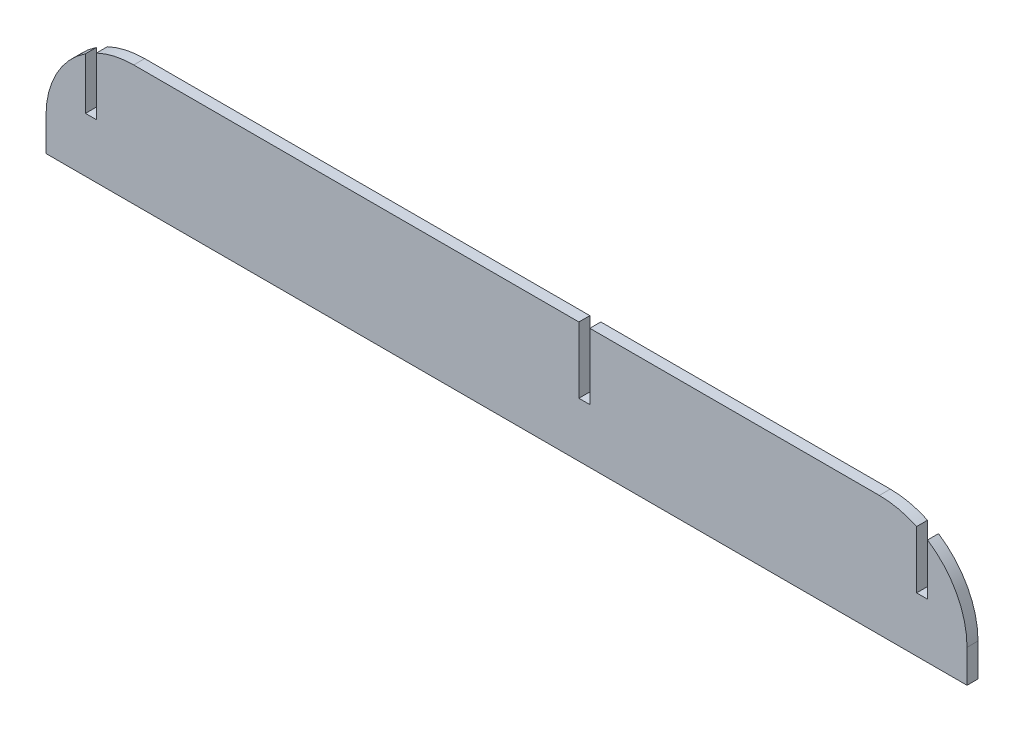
ISO-10303-21;
HEADER;
FILE_DESCRIPTION(('STEP AP214'),'2;1');
FILE_NAME('part.step','',(''),(''),'','','');
FILE_SCHEMA(('AUTOMOTIVE_DESIGN { 1 0 10303 214 1 1 1 1 }'));
ENDSEC;
DATA;
#1=APPLICATION_CONTEXT('core data for automotive mechanical design processes');
#2=APPLICATION_PROTOCOL_DEFINITION('international standard','automotive_design',2000,#1);
#3=PRODUCT_CONTEXT('',#1,'mechanical');
#4=PRODUCT('Part','Part','',(#3));
#5=PRODUCT_RELATED_PRODUCT_CATEGORY('part','',(#4));
#6=PRODUCT_DEFINITION_FORMATION('','',#4);
#7=PRODUCT_DEFINITION_CONTEXT('part definition',#1,'design');
#8=PRODUCT_DEFINITION('design','',#6,#7);
#9=PRODUCT_DEFINITION_SHAPE('','',#8);
#10=(LENGTH_UNIT() NAMED_UNIT(*) SI_UNIT(.MILLI.,.METRE.));
#11=(NAMED_UNIT(*) PLANE_ANGLE_UNIT() SI_UNIT($,.RADIAN.));
#12=(NAMED_UNIT(*) SI_UNIT($,.STERADIAN.) SOLID_ANGLE_UNIT());
#13=UNCERTAINTY_MEASURE_WITH_UNIT(LENGTH_MEASURE(1.E-05),#10,'distance_accuracy_value','');
#14=(GEOMETRIC_REPRESENTATION_CONTEXT(3) GLOBAL_UNCERTAINTY_ASSIGNED_CONTEXT((#13)) GLOBAL_UNIT_ASSIGNED_CONTEXT((#10,
#11,#12)) REPRESENTATION_CONTEXT('',''));
#15=CARTESIAN_POINT('',(0.,0.,0.));
#16=DIRECTION('',(0.,0.,1.));
#17=DIRECTION('',(1.,0.,0.));
#18=AXIS2_PLACEMENT_3D('',#15,#16,#17);
#19=CARTESIAN_POINT('',(-210.,55.,5.));
#20=DIRECTION('',(0.,-1.,0.));
#21=DIRECTION('',(0.,0.,-1.));
#22=AXIS2_PLACEMENT_3D('',#19,#20,#21);
#23=PLANE('',#22);
#24=DIRECTION('',(0.,0.,-1.));
#25=VECTOR('',#24,1.);
#26=CARTESIAN_POINT('',(33.,55.,5.));
#27=LINE('',#26,#25);
#28=CARTESIAN_POINT('',(33.,55.,5.));
#29=VERTEX_POINT('',#28);
#30=CARTESIAN_POINT('',(33.,55.,0.));
#31=VERTEX_POINT('',#30);
#32=EDGE_CURVE('E201',#29,#31,#27,.T.);
#33=ORIENTED_EDGE('',*,*,#32,.T.);
#34=DIRECTION('',(-1.,0.,0.));
#35=VECTOR('',#34,1.);
#36=CARTESIAN_POINT('',(-210.,55.,0.));
#37=LINE('',#36,#35);
#38=CARTESIAN_POINT('',(-170.,55.,0.));
#39=VERTEX_POINT('',#38);
#40=EDGE_CURVE('E254',#31,#39,#37,.T.);
#41=ORIENTED_EDGE('',*,*,#40,.T.);
#42=DIRECTION('',(0.,0.,-1.));
#43=VECTOR('',#42,1.);
#44=CARTESIAN_POINT('',(-170.,55.,5.));
#45=LINE('',#44,#43);
#46=CARTESIAN_POINT('',(-170.,55.,5.));
#47=VERTEX_POINT('',#46);
#48=EDGE_CURVE('E262',#39,#47,#45,.F.);
#49=ORIENTED_EDGE('',*,*,#48,.T.);
#50=DIRECTION('',(-1.,0.,0.));
#51=VECTOR('',#50,1.);
#52=CARTESIAN_POINT('',(-210.,55.,5.));
#53=LINE('',#52,#51);
#54=EDGE_CURVE('E243',#29,#47,#53,.T.);
#55=ORIENTED_EDGE('',*,*,#54,.F.);
#56=EDGE_LOOP('',(#33,#41,#49,#55));
#57=FACE_BOUND('',#56,.T.);
#58=ADVANCED_FACE('F33',(#57),#23,.F.);
#59=CARTESIAN_POINT('',(0.,0.,5.));
#60=DIRECTION('',(0.,0.,-1.));
#61=DIRECTION('',(-1.,0.,0.));
#62=AXIS2_PLACEMENT_3D('',#59,#60,#61);
#63=PLANE('',#62);
#64=DIRECTION('',(0.,-1.,0.));
#65=VECTOR('',#64,1.);
#66=CARTESIAN_POINT('',(186.999999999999,0.,5.));
#67=LINE('',#66,#65);
#68=CARTESIAN_POINT('',(186.999999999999,51.2077339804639,5.));
#69=VERTEX_POINT('',#68);
#70=CARTESIAN_POINT('',(186.999999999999,25.,5.));
#71=VERTEX_POINT('',#70);
#72=EDGE_CURVE('E179',#69,#71,#67,.T.);
#73=ORIENTED_EDGE('',*,*,#72,.F.);
#74=CARTESIAN_POINT('',(170.,15.,5.));
#75=DIRECTION('',(0.,0.,-1.));
#76=DIRECTION('',(-1.,0.,0.));
#77=AXIS2_PLACEMENT_3D('',#74,#75,#76);
#78=CIRCLE('',#77,40.);
#79=CARTESIAN_POINT('',(170.,55.,5.));
#80=VERTEX_POINT('',#79);
#81=EDGE_CURVE('E282',#69,#80,#78,.F.);
#82=ORIENTED_EDGE('',*,*,#81,.T.);
#83=CARTESIAN_POINT('',(38.,55.,5.));
#84=VERTEX_POINT('',#83);
#85=EDGE_CURVE('E244',#80,#84,#53,.T.);
#86=ORIENTED_EDGE('',*,*,#85,.T.);
#87=DIRECTION('',(0.,-1.,0.));
#88=VECTOR('',#87,1.);
#89=CARTESIAN_POINT('',(38.,0.,5.));
#90=LINE('',#89,#88);
#91=CARTESIAN_POINT('',(38.,24.8636187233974,5.));
#92=VERTEX_POINT('',#91);
#93=EDGE_CURVE('E194',#84,#92,#90,.T.);
#94=ORIENTED_EDGE('',*,*,#93,.T.);
#95=DIRECTION('',(-1.,0.,0.));
#96=VECTOR('',#95,1.);
#97=CARTESIAN_POINT('',(0.,24.8636187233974,5.));
#98=LINE('',#97,#96);
#99=CARTESIAN_POINT('',(33.,24.8636187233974,5.));
#100=VERTEX_POINT('',#99);
#101=EDGE_CURVE('E198',#92,#100,#98,.T.);
#102=ORIENTED_EDGE('',*,*,#101,.T.);
#103=DIRECTION('',(0.,-1.,0.));
#104=VECTOR('',#103,1.);
#105=CARTESIAN_POINT('',(33.,0.,5.));
#106=LINE('',#105,#104);
#107=EDGE_CURVE('E192',#29,#100,#106,.T.);
#108=ORIENTED_EDGE('',*,*,#107,.F.);
#109=ORIENTED_EDGE('',*,*,#54,.T.);
#110=CARTESIAN_POINT('',(-170.,15.,5.));
#111=DIRECTION('',(0.,0.,-1.));
#112=DIRECTION('',(-1.,0.,0.));
#113=AXIS2_PLACEMENT_3D('',#110,#111,#112);
#114=CIRCLE('',#113,40.);
#115=CARTESIAN_POINT('',(-187.000000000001,51.2077339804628,5.));
#116=VERTEX_POINT('',#115);
#117=EDGE_CURVE('E279',#47,#116,#114,.F.);
#118=ORIENTED_EDGE('',*,*,#117,.T.);
#119=DIRECTION('',(0.,-1.,0.));
#120=VECTOR('',#119,1.);
#121=CARTESIAN_POINT('',(-187.000000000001,0.,5.));
#122=LINE('',#121,#120);
#123=CARTESIAN_POINT('',(-187.000000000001,24.8636187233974,5.));
#124=VERTEX_POINT('',#123);
#125=EDGE_CURVE('E218',#116,#124,#122,.T.);
#126=ORIENTED_EDGE('',*,*,#125,.T.);
#127=DIRECTION('',(-1.,0.,0.));
#128=VECTOR('',#127,1.);
#129=CARTESIAN_POINT('',(0.,24.8636187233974,5.));
#130=LINE('',#129,#128);
#131=CARTESIAN_POINT('',(-192.000000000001,24.8636187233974,5.));
#132=VERTEX_POINT('',#131);
#133=EDGE_CURVE('E222',#124,#132,#130,.T.);
#134=ORIENTED_EDGE('',*,*,#133,.T.);
#135=DIRECTION('',(0.,-1.,0.));
#136=VECTOR('',#135,1.);
#137=CARTESIAN_POINT('',(-192.000000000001,0.,5.));
#138=LINE('',#137,#136);
#139=CARTESIAN_POINT('',(-192.000000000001,48.4065861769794,5.));
#140=VERTEX_POINT('',#139);
#141=EDGE_CURVE('E216',#140,#132,#138,.T.);
#142=ORIENTED_EDGE('',*,*,#141,.F.);
#143=CARTESIAN_POINT('',(-210.,15.,5.));
#144=VERTEX_POINT('',#143);
#145=EDGE_CURVE('E278',#140,#144,#114,.F.);
#146=ORIENTED_EDGE('',*,*,#145,.T.);
#147=DIRECTION('',(0.,-1.,0.));
#148=VECTOR('',#147,1.);
#149=CARTESIAN_POINT('',(-210.,0.,5.));
#150=LINE('',#149,#148);
#151=CARTESIAN_POINT('',(-210.,0.,5.));
#152=VERTEX_POINT('',#151);
#153=EDGE_CURVE('E236',#144,#152,#150,.T.);
#154=ORIENTED_EDGE('',*,*,#153,.T.);
#155=DIRECTION('',(1.,0.,0.));
#156=VECTOR('',#155,1.);
#157=CARTESIAN_POINT('',(-210.,0.,5.));
#158=LINE('',#157,#156);
#159=CARTESIAN_POINT('',(210.,0.,5.));
#160=VERTEX_POINT('',#159);
#161=EDGE_CURVE('E238',#152,#160,#158,.T.);
#162=ORIENTED_EDGE('',*,*,#161,.T.);
#163=DIRECTION('',(0.,1.,0.));
#164=VECTOR('',#163,1.);
#165=CARTESIAN_POINT('',(210.,0.,5.));
#166=LINE('',#165,#164);
#167=CARTESIAN_POINT('',(210.,15.,5.));
#168=VERTEX_POINT('',#167);
#169=EDGE_CURVE('E241',#160,#168,#166,.T.);
#170=ORIENTED_EDGE('',*,*,#169,.T.);
#171=CARTESIAN_POINT('',(191.999999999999,48.4065861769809,5.));
#172=VERTEX_POINT('',#171);
#173=EDGE_CURVE('E178',#168,#172,#78,.F.);
#174=ORIENTED_EDGE('',*,*,#173,.T.);
#175=DIRECTION('',(0.,-1.,0.));
#176=VECTOR('',#175,1.);
#177=CARTESIAN_POINT('',(191.999999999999,0.,5.));
#178=LINE('',#177,#176);
#179=CARTESIAN_POINT('',(191.999999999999,25.,5.));
#180=VERTEX_POINT('',#179);
#181=EDGE_CURVE('E56',#172,#180,#178,.T.);
#182=ORIENTED_EDGE('',*,*,#181,.T.);
#183=DIRECTION('',(-1.,0.,0.));
#184=VECTOR('',#183,1.);
#185=CARTESIAN_POINT('',(0.,25.,5.));
#186=LINE('',#185,#184);
#187=EDGE_CURVE('E166',#180,#71,#186,.T.);
#188=ORIENTED_EDGE('',*,*,#187,.T.);
#189=EDGE_LOOP('',(#73,#82,#86,#94,#102,#108,#109,#118,#126,#134,#142,#146,#154,#162,#170,#174,
#182,#188));
#190=FACE_BOUND('',#189,.T.);
#191=ADVANCED_FACE('F175',(#190),#63,.F.);
#192=CARTESIAN_POINT('',(0.,0.,0.));
#193=DIRECTION('',(0.,0.,-1.));
#194=DIRECTION('',(-1.,0.,0.));
#195=AXIS2_PLACEMENT_3D('',#192,#193,#194);
#196=PLANE('',#195);
#197=CARTESIAN_POINT('',(170.,15.,0.));
#198=DIRECTION('',(0.,0.,-1.));
#199=DIRECTION('',(-1.,0.,0.));
#200=AXIS2_PLACEMENT_3D('',#197,#198,#199);
#201=CIRCLE('',#200,40.);
#202=CARTESIAN_POINT('',(170.,55.,0.));
#203=VERTEX_POINT('',#202);
#204=CARTESIAN_POINT('',(186.999999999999,51.2077339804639,0.));
#205=VERTEX_POINT('',#204);
#206=EDGE_CURVE('E273',#203,#205,#201,.T.);
#207=ORIENTED_EDGE('',*,*,#206,.T.);
#208=DIRECTION('',(0.,-1.,0.));
#209=VECTOR('',#208,1.);
#210=CARTESIAN_POINT('',(186.999999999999,0.,0.));
#211=LINE('',#210,#209);
#212=CARTESIAN_POINT('',(186.999999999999,25.,0.));
#213=VERTEX_POINT('',#212);
#214=EDGE_CURVE('E184',#205,#213,#211,.T.);
#215=ORIENTED_EDGE('',*,*,#214,.T.);
#216=DIRECTION('',(-1.,0.,0.));
#217=VECTOR('',#216,1.);
#218=CARTESIAN_POINT('',(0.,25.,0.));
#219=LINE('',#218,#217);
#220=CARTESIAN_POINT('',(191.999999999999,25.,0.));
#221=VERTEX_POINT('',#220);
#222=EDGE_CURVE('E181',#221,#213,#219,.T.);
#223=ORIENTED_EDGE('',*,*,#222,.F.);
#224=DIRECTION('',(0.,-1.,0.));
#225=VECTOR('',#224,1.);
#226=CARTESIAN_POINT('',(191.999999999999,0.,0.));
#227=LINE('',#226,#225);
#228=CARTESIAN_POINT('',(191.999999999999,48.4065861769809,0.));
#229=VERTEX_POINT('',#228);
#230=EDGE_CURVE('E161',#229,#221,#227,.T.);
#231=ORIENTED_EDGE('',*,*,#230,.F.);
#232=CARTESIAN_POINT('',(210.,15.,0.));
#233=VERTEX_POINT('',#232);
#234=EDGE_CURVE('E272',#229,#233,#201,.T.);
#235=ORIENTED_EDGE('',*,*,#234,.T.);
#236=DIRECTION('',(0.,1.,0.));
#237=VECTOR('',#236,1.);
#238=CARTESIAN_POINT('',(210.,0.,0.));
#239=LINE('',#238,#237);
#240=CARTESIAN_POINT('',(210.,0.,0.));
#241=VERTEX_POINT('',#240);
#242=EDGE_CURVE('E251',#241,#233,#239,.T.);
#243=ORIENTED_EDGE('',*,*,#242,.F.);
#244=DIRECTION('',(1.,0.,0.));
#245=VECTOR('',#244,1.);
#246=CARTESIAN_POINT('',(-210.,0.,0.));
#247=LINE('',#246,#245);
#248=CARTESIAN_POINT('',(-210.,0.,0.));
#249=VERTEX_POINT('',#248);
#250=EDGE_CURVE('E249',#249,#241,#247,.T.);
#251=ORIENTED_EDGE('',*,*,#250,.F.);
#252=DIRECTION('',(0.,-1.,0.));
#253=VECTOR('',#252,1.);
#254=CARTESIAN_POINT('',(-210.,0.,0.));
#255=LINE('',#254,#253);
#256=CARTESIAN_POINT('',(-210.,15.,0.));
#257=VERTEX_POINT('',#256);
#258=EDGE_CURVE('E190',#257,#249,#255,.T.);
#259=ORIENTED_EDGE('',*,*,#258,.F.);
#260=CARTESIAN_POINT('',(-170.,15.,0.));
#261=DIRECTION('',(0.,0.,-1.));
#262=DIRECTION('',(-1.,0.,0.));
#263=AXIS2_PLACEMENT_3D('',#260,#261,#262);
#264=CIRCLE('',#263,40.);
#265=CARTESIAN_POINT('',(-192.000000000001,48.4065861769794,0.));
#266=VERTEX_POINT('',#265);
#267=EDGE_CURVE('E269',#257,#266,#264,.T.);
#268=ORIENTED_EDGE('',*,*,#267,.T.);
#269=DIRECTION('',(0.,-1.,0.));
#270=VECTOR('',#269,1.);
#271=CARTESIAN_POINT('',(-192.000000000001,0.,0.));
#272=LINE('',#271,#270);
#273=CARTESIAN_POINT('',(-192.000000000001,24.8636187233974,0.));
#274=VERTEX_POINT('',#273);
#275=EDGE_CURVE('E226',#266,#274,#272,.T.);
#276=ORIENTED_EDGE('',*,*,#275,.T.);
#277=DIRECTION('',(-1.,0.,0.));
#278=VECTOR('',#277,1.);
#279=CARTESIAN_POINT('',(0.,24.8636187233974,0.));
#280=LINE('',#279,#278);
#281=CARTESIAN_POINT('',(-187.000000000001,24.8636187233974,0.));
#282=VERTEX_POINT('',#281);
#283=EDGE_CURVE('E219',#282,#274,#280,.T.);
#284=ORIENTED_EDGE('',*,*,#283,.F.);
#285=DIRECTION('',(0.,-1.,0.));
#286=VECTOR('',#285,1.);
#287=CARTESIAN_POINT('',(-187.000000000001,0.,0.));
#288=LINE('',#287,#286);
#289=CARTESIAN_POINT('',(-187.000000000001,51.2077339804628,0.));
#290=VERTEX_POINT('',#289);
#291=EDGE_CURVE('E229',#290,#282,#288,.T.);
#292=ORIENTED_EDGE('',*,*,#291,.F.);
#293=EDGE_CURVE('E268',#290,#39,#264,.T.);
#294=ORIENTED_EDGE('',*,*,#293,.T.);
#295=ORIENTED_EDGE('',*,*,#40,.F.);
#296=DIRECTION('',(0.,-1.,0.));
#297=VECTOR('',#296,1.);
#298=CARTESIAN_POINT('',(33.,0.,0.));
#299=LINE('',#298,#297);
#300=CARTESIAN_POINT('',(33.,24.8636187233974,0.));
#301=VERTEX_POINT('',#300);
#302=EDGE_CURVE('E202',#31,#301,#299,.T.);
#303=ORIENTED_EDGE('',*,*,#302,.T.);
#304=DIRECTION('',(-1.,0.,0.));
#305=VECTOR('',#304,1.);
#306=CARTESIAN_POINT('',(0.,24.8636187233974,0.));
#307=LINE('',#306,#305);
#308=CARTESIAN_POINT('',(38.,24.8636187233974,0.));
#309=VERTEX_POINT('',#308);
#310=EDGE_CURVE('E195',#309,#301,#307,.T.);
#311=ORIENTED_EDGE('',*,*,#310,.F.);
#312=DIRECTION('',(0.,-1.,0.));
#313=VECTOR('',#312,1.);
#314=CARTESIAN_POINT('',(38.,0.,0.));
#315=LINE('',#314,#313);
#316=CARTESIAN_POINT('',(38.,55.,0.));
#317=VERTEX_POINT('',#316);
#318=EDGE_CURVE('E205',#317,#309,#315,.T.);
#319=ORIENTED_EDGE('',*,*,#318,.F.);
#320=EDGE_CURVE('E239',#203,#317,#37,.T.);
#321=ORIENTED_EDGE('',*,*,#320,.F.);
#322=EDGE_LOOP('',(#207,#215,#223,#231,#235,#243,#251,#259,#268,#276,#284,#292,#294,#295,#303,
#311,#319,#321));
#323=FACE_BOUND('',#322,.T.);
#324=ADVANCED_FACE('F294',(#323),#196,.T.);
#325=CARTESIAN_POINT('',(170.,15.,5.));
#326=DIRECTION('',(0.,0.,-1.));
#327=DIRECTION('',(-1.,0.,0.));
#328=AXIS2_PLACEMENT_3D('',#325,#326,#327);
#329=CYLINDRICAL_SURFACE('',#328,40.);
#330=ORIENTED_EDGE('',*,*,#81,.F.);
#331=DIRECTION('',(0.,0.,-1.));
#332=VECTOR('',#331,1.);
#333=CARTESIAN_POINT('',(186.999999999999,51.2077339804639,5.));
#334=LINE('',#333,#332);
#335=EDGE_CURVE('E11',#69,#205,#334,.T.);
#336=ORIENTED_EDGE('',*,*,#335,.T.);
#337=ORIENTED_EDGE('',*,*,#206,.F.);
#338=DIRECTION('',(0.,0.,-1.));
#339=VECTOR('',#338,1.);
#340=CARTESIAN_POINT('',(170.,55.,5.));
#341=LINE('',#340,#339);
#342=EDGE_CURVE('E265',#80,#203,#341,.T.);
#343=ORIENTED_EDGE('',*,*,#342,.F.);
#344=EDGE_LOOP('',(#330,#336,#337,#343));
#345=FACE_BOUND('',#344,.T.);
#346=ADVANCED_FACE('F351',(#345),#329,.T.);
#347=CARTESIAN_POINT('',(-170.,15.,5.));
#348=DIRECTION('',(0.,0.,-1.));
#349=DIRECTION('',(-1.,0.,0.));
#350=AXIS2_PLACEMENT_3D('',#347,#348,#349);
#351=CYLINDRICAL_SURFACE('',#350,40.);
#352=ORIENTED_EDGE('',*,*,#145,.F.);
#353=DIRECTION('',(0.,0.,-1.));
#354=VECTOR('',#353,1.);
#355=CARTESIAN_POINT('',(-192.000000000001,48.4065861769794,5.));
#356=LINE('',#355,#354);
#357=EDGE_CURVE('E289',#140,#266,#356,.T.);
#358=ORIENTED_EDGE('',*,*,#357,.T.);
#359=ORIENTED_EDGE('',*,*,#267,.F.);
#360=DIRECTION('',(0.,0.,-1.));
#361=VECTOR('',#360,1.);
#362=CARTESIAN_POINT('',(-210.,15.,5.));
#363=LINE('',#362,#361);
#364=EDGE_CURVE('E284',#144,#257,#363,.T.);
#365=ORIENTED_EDGE('',*,*,#364,.F.);
#366=EDGE_LOOP('',(#352,#358,#359,#365));
#367=FACE_BOUND('',#366,.T.);
#368=ADVANCED_FACE('F314',(#367),#351,.T.);
#369=CARTESIAN_POINT('',(-210.,0.,5.));
#370=DIRECTION('',(1.,0.,0.));
#371=DIRECTION('',(0.,0.,-1.));
#372=AXIS2_PLACEMENT_3D('',#369,#370,#371);
#373=PLANE('',#372);
#374=ORIENTED_EDGE('',*,*,#153,.F.);
#375=ORIENTED_EDGE('',*,*,#364,.T.);
#376=ORIENTED_EDGE('',*,*,#258,.T.);
#377=DIRECTION('',(0.,0.,-1.));
#378=VECTOR('',#377,1.);
#379=CARTESIAN_POINT('',(-210.,0.,5.));
#380=LINE('',#379,#378);
#381=EDGE_CURVE('E259',#152,#249,#380,.T.);
#382=ORIENTED_EDGE('',*,*,#381,.F.);
#383=EDGE_LOOP('',(#374,#375,#376,#382));
#384=FACE_BOUND('',#383,.T.);
#385=ADVANCED_FACE('F310',(#384),#373,.F.);
#386=CARTESIAN_POINT('',(-210.,0.,5.));
#387=DIRECTION('',(0.,1.,0.));
#388=DIRECTION('',(0.,0.,1.));
#389=AXIS2_PLACEMENT_3D('',#386,#387,#388);
#390=PLANE('',#389);
#391=ORIENTED_EDGE('',*,*,#250,.T.);
#392=DIRECTION('',(0.,0.,-1.));
#393=VECTOR('',#392,1.);
#394=CARTESIAN_POINT('',(210.,0.,5.));
#395=LINE('',#394,#393);
#396=EDGE_CURVE('E247',#160,#241,#395,.T.);
#397=ORIENTED_EDGE('',*,*,#396,.F.);
#398=ORIENTED_EDGE('',*,*,#161,.F.);
#399=ORIENTED_EDGE('',*,*,#381,.T.);
#400=EDGE_LOOP('',(#391,#397,#398,#399));
#401=FACE_BOUND('',#400,.T.);
#402=ADVANCED_FACE('F306',(#401),#390,.F.);
#403=CARTESIAN_POINT('',(210.,0.,5.));
#404=DIRECTION('',(-1.,0.,0.));
#405=DIRECTION('',(0.,0.,1.));
#406=AXIS2_PLACEMENT_3D('',#403,#404,#405);
#407=PLANE('',#406);
#408=ORIENTED_EDGE('',*,*,#242,.T.);
#409=DIRECTION('',(0.,0.,-1.));
#410=VECTOR('',#409,1.);
#411=CARTESIAN_POINT('',(210.,15.,5.));
#412=LINE('',#411,#410);
#413=EDGE_CURVE('E276',#233,#168,#412,.F.);
#414=ORIENTED_EDGE('',*,*,#413,.T.);
#415=ORIENTED_EDGE('',*,*,#169,.F.);
#416=ORIENTED_EDGE('',*,*,#396,.T.);
#417=EDGE_LOOP('',(#408,#414,#415,#416));
#418=FACE_BOUND('',#417,.T.);
#419=ADVANCED_FACE('F300',(#418),#407,.F.);
#420=ORIENTED_EDGE('',*,*,#320,.T.);
#421=DIRECTION('',(0.,0.,-1.));
#422=VECTOR('',#421,1.);
#423=CARTESIAN_POINT('',(38.,55.,5.));
#424=LINE('',#423,#422);
#425=EDGE_CURVE('E48',#84,#317,#424,.T.);
#426=ORIENTED_EDGE('',*,*,#425,.F.);
#427=ORIENTED_EDGE('',*,*,#85,.F.);
#428=ORIENTED_EDGE('',*,*,#342,.T.);
#429=EDGE_LOOP('',(#420,#426,#427,#428));
#430=FACE_BOUND('',#429,.T.);
#431=ADVANCED_FACE('F346',(#430),#23,.F.);
#432=DIRECTION('',(0.,0.,-1.));
#433=VECTOR('',#432,1.);
#434=CARTESIAN_POINT('',(191.999999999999,48.4065861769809,5.));
#435=LINE('',#434,#433);
#436=EDGE_CURVE('E41',#172,#229,#435,.T.);
#437=ORIENTED_EDGE('',*,*,#436,.F.);
#438=ORIENTED_EDGE('',*,*,#173,.F.);
#439=ORIENTED_EDGE('',*,*,#413,.F.);
#440=ORIENTED_EDGE('',*,*,#234,.F.);
#441=EDGE_LOOP('',(#437,#438,#439,#440));
#442=FACE_BOUND('',#441,.T.);
#443=ADVANCED_FACE('F297',(#442),#329,.T.);
#444=DIRECTION('',(0.,0.,-1.));
#445=VECTOR('',#444,1.);
#446=CARTESIAN_POINT('',(-187.000000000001,51.2077339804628,5.));
#447=LINE('',#446,#445);
#448=EDGE_CURVE('E287',#116,#290,#447,.T.);
#449=ORIENTED_EDGE('',*,*,#448,.F.);
#450=ORIENTED_EDGE('',*,*,#117,.F.);
#451=ORIENTED_EDGE('',*,*,#48,.F.);
#452=ORIENTED_EDGE('',*,*,#293,.F.);
#453=EDGE_LOOP('',(#449,#450,#451,#452));
#454=FACE_BOUND('',#453,.T.);
#455=ADVANCED_FACE('F35',(#454),#351,.T.);
#456=CARTESIAN_POINT('',(-192.000000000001,0.,5.));
#457=DIRECTION('',(1.,0.,0.));
#458=DIRECTION('',(0.,0.,-1.));
#459=AXIS2_PLACEMENT_3D('',#456,#457,#458);
#460=PLANE('',#459);
#461=ORIENTED_EDGE('',*,*,#141,.T.);
#462=DIRECTION('',(0.,0.,-1.));
#463=VECTOR('',#462,1.);
#464=CARTESIAN_POINT('',(-192.000000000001,24.8636187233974,5.));
#465=LINE('',#464,#463);
#466=EDGE_CURVE('E206',#132,#274,#465,.T.);
#467=ORIENTED_EDGE('',*,*,#466,.T.);
#468=ORIENTED_EDGE('',*,*,#275,.F.);
#469=ORIENTED_EDGE('',*,*,#357,.F.);
#470=EDGE_LOOP('',(#461,#467,#468,#469));
#471=FACE_BOUND('',#470,.T.);
#472=ADVANCED_FACE('F318',(#471),#460,.T.);
#473=CARTESIAN_POINT('',(0.,24.8636187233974,5.));
#474=DIRECTION('',(0.,-1.,0.));
#475=DIRECTION('',(0.,0.,-1.));
#476=AXIS2_PLACEMENT_3D('',#473,#474,#475);
#477=PLANE('',#476);
#478=ORIENTED_EDGE('',*,*,#283,.T.);
#479=ORIENTED_EDGE('',*,*,#466,.F.);
#480=ORIENTED_EDGE('',*,*,#133,.F.);
#481=DIRECTION('',(0.,0.,-1.));
#482=VECTOR('',#481,1.);
#483=CARTESIAN_POINT('',(-187.000000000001,24.8636187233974,5.));
#484=LINE('',#483,#482);
#485=EDGE_CURVE('E225',#124,#282,#484,.T.);
#486=ORIENTED_EDGE('',*,*,#485,.T.);
#487=EDGE_LOOP('',(#478,#479,#480,#486));
#488=FACE_BOUND('',#487,.T.);
#489=ADVANCED_FACE('F323',(#488),#477,.F.);
#490=CARTESIAN_POINT('',(-187.000000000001,0.,5.));
#491=DIRECTION('',(1.,0.,0.));
#492=DIRECTION('',(0.,0.,-1.));
#493=AXIS2_PLACEMENT_3D('',#490,#491,#492);
#494=PLANE('',#493);
#495=ORIENTED_EDGE('',*,*,#448,.T.);
#496=ORIENTED_EDGE('',*,*,#291,.T.);
#497=ORIENTED_EDGE('',*,*,#485,.F.);
#498=ORIENTED_EDGE('',*,*,#125,.F.);
#499=EDGE_LOOP('',(#495,#496,#497,#498));
#500=FACE_BOUND('',#499,.T.);
#501=ADVANCED_FACE('F325',(#500),#494,.F.);
#502=CARTESIAN_POINT('',(186.999999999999,0.,5.));
#503=DIRECTION('',(1.,0.,0.));
#504=DIRECTION('',(0.,0.,-1.));
#505=AXIS2_PLACEMENT_3D('',#502,#503,#504);
#506=PLANE('',#505);
#507=ORIENTED_EDGE('',*,*,#72,.T.);
#508=DIRECTION('',(0.,0.,-1.));
#509=VECTOR('',#508,1.);
#510=CARTESIAN_POINT('',(186.999999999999,25.,5.));
#511=LINE('',#510,#509);
#512=EDGE_CURVE('E165',#71,#213,#511,.T.);
#513=ORIENTED_EDGE('',*,*,#512,.T.);
#514=ORIENTED_EDGE('',*,*,#214,.F.);
#515=ORIENTED_EDGE('',*,*,#335,.F.);
#516=EDGE_LOOP('',(#507,#513,#514,#515));
#517=FACE_BOUND('',#516,.T.);
#518=ADVANCED_FACE('F353',(#517),#506,.T.);
#519=CARTESIAN_POINT('',(0.,25.,5.));
#520=DIRECTION('',(0.,-1.,0.));
#521=DIRECTION('',(0.,0.,-1.));
#522=AXIS2_PLACEMENT_3D('',#519,#520,#521);
#523=PLANE('',#522);
#524=ORIENTED_EDGE('',*,*,#222,.T.);
#525=ORIENTED_EDGE('',*,*,#512,.F.);
#526=ORIENTED_EDGE('',*,*,#187,.F.);
#527=DIRECTION('',(0.,0.,-1.));
#528=VECTOR('',#527,1.);
#529=CARTESIAN_POINT('',(191.999999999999,25.,5.));
#530=LINE('',#529,#528);
#531=EDGE_CURVE('E157',#180,#221,#530,.T.);
#532=ORIENTED_EDGE('',*,*,#531,.T.);
#533=EDGE_LOOP('',(#524,#525,#526,#532));
#534=FACE_BOUND('',#533,.T.);
#535=ADVANCED_FACE('F170',(#534),#523,.F.);
#536=CARTESIAN_POINT('',(191.999999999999,0.,5.));
#537=DIRECTION('',(1.,0.,0.));
#538=DIRECTION('',(0.,0.,-1.));
#539=AXIS2_PLACEMENT_3D('',#536,#537,#538);
#540=PLANE('',#539);
#541=ORIENTED_EDGE('',*,*,#436,.T.);
#542=ORIENTED_EDGE('',*,*,#230,.T.);
#543=ORIENTED_EDGE('',*,*,#531,.F.);
#544=ORIENTED_EDGE('',*,*,#181,.F.);
#545=EDGE_LOOP('',(#541,#542,#543,#544));
#546=FACE_BOUND('',#545,.T.);
#547=ADVANCED_FACE('F159',(#546),#540,.F.);
#548=CARTESIAN_POINT('',(33.,0.,5.));
#549=DIRECTION('',(1.,0.,0.));
#550=DIRECTION('',(0.,0.,-1.));
#551=AXIS2_PLACEMENT_3D('',#548,#549,#550);
#552=PLANE('',#551);
#553=ORIENTED_EDGE('',*,*,#302,.F.);
#554=ORIENTED_EDGE('',*,*,#32,.F.);
#555=ORIENTED_EDGE('',*,*,#107,.T.);
#556=DIRECTION('',(0.,0.,-1.));
#557=VECTOR('',#556,1.);
#558=CARTESIAN_POINT('',(33.,24.8636187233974,5.));
#559=LINE('',#558,#557);
#560=EDGE_CURVE('E187',#100,#301,#559,.T.);
#561=ORIENTED_EDGE('',*,*,#560,.T.);
#562=EDGE_LOOP('',(#553,#554,#555,#561));
#563=FACE_BOUND('',#562,.T.);
#564=ADVANCED_FACE('F337',(#563),#552,.T.);
#565=CARTESIAN_POINT('',(0.,24.8636187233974,5.));
#566=DIRECTION('',(0.,-1.,0.));
#567=DIRECTION('',(0.,0.,-1.));
#568=AXIS2_PLACEMENT_3D('',#565,#566,#567);
#569=PLANE('',#568);
#570=ORIENTED_EDGE('',*,*,#310,.T.);
#571=ORIENTED_EDGE('',*,*,#560,.F.);
#572=ORIENTED_EDGE('',*,*,#101,.F.);
#573=DIRECTION('',(0.,0.,-1.));
#574=VECTOR('',#573,1.);
#575=CARTESIAN_POINT('',(38.,24.8636187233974,5.));
#576=LINE('',#575,#574);
#577=EDGE_CURVE('E211',#92,#309,#576,.T.);
#578=ORIENTED_EDGE('',*,*,#577,.T.);
#579=EDGE_LOOP('',(#570,#571,#572,#578));
#580=FACE_BOUND('',#579,.T.);
#581=ADVANCED_FACE('F342',(#580),#569,.F.);
#582=CARTESIAN_POINT('',(38.,0.,5.));
#583=DIRECTION('',(1.,0.,0.));
#584=DIRECTION('',(0.,1.,0.));
#585=AXIS2_PLACEMENT_3D('',#582,#583,#584);
#586=PLANE('',#585);
#587=ORIENTED_EDGE('',*,*,#318,.T.);
#588=ORIENTED_EDGE('',*,*,#577,.F.);
#589=ORIENTED_EDGE('',*,*,#93,.F.);
#590=ORIENTED_EDGE('',*,*,#425,.T.);
#591=EDGE_LOOP('',(#587,#588,#589,#590));
#592=FACE_BOUND('',#591,.T.);
#593=ADVANCED_FACE('F343',(#592),#586,.F.);
#594=CLOSED_SHELL('',(#58,#191,#324,#346,#368,#385,#402,#419,#431,#443,#455,#472,#489,#501,#518,
#535,#547,#564,#581,#593));
#595=MANIFOLD_SOLID_BREP('B2',#594);
#596=ADVANCED_BREP_SHAPE_REPRESENTATION('',(#18,#595),#14);
#597=SHAPE_DEFINITION_REPRESENTATION(#9,#596);
ENDSEC;
END-ISO-10303-21;
